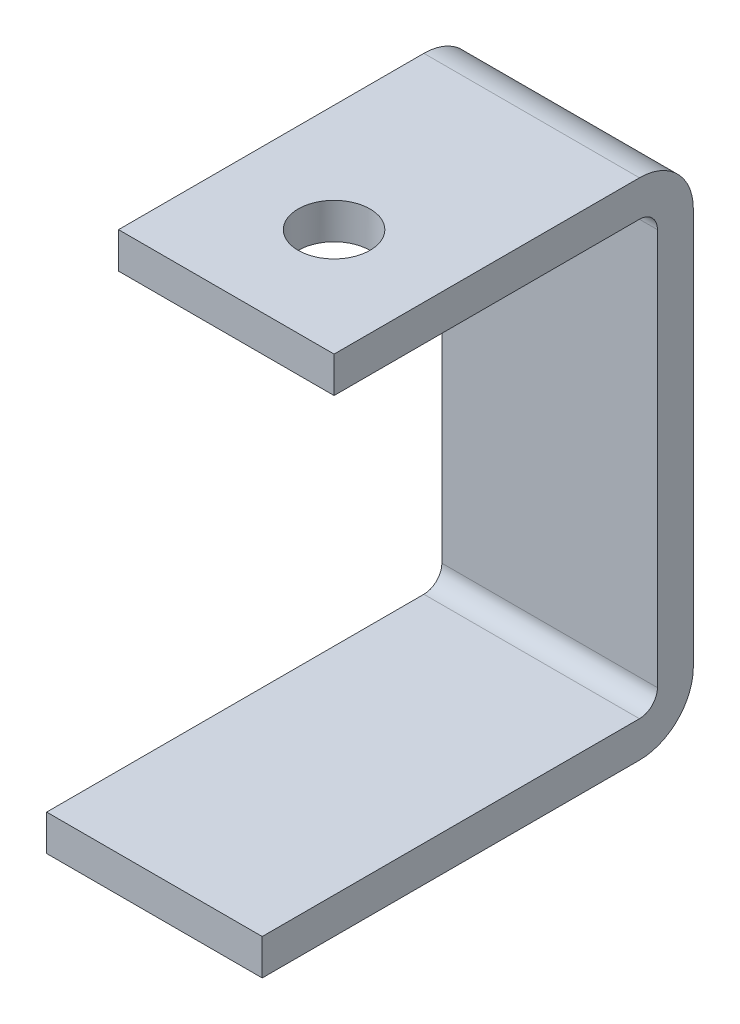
from build123d import *

# Parameters (mm, degrees)
BASE_EXTRUDE_THIN_DEPTH = 19.05
CUT_EXTRUDE1_REACH      = 116.849
SKETCH2_R               = 6.35


with BuildPart() as part:
    # Sketch1 → Base-Extrude-Thin (new, symmetric)
    with BuildSketch(Plane(origin=(0, 0, 0), x_dir=(0, 0, -1), z_dir=(1, 0, 0))):
        with BuildLine():
            Line((-69.85, 0), (-44.45, 0))
            Line((-44.45, 0), (-3.175, 0))
            ThreePointArc((-3.175, 0), (-0.92993597, 0.92993597), (0, 3.175))
            Line((0, 3.175), (0, 73.279))
            ThreePointArc((0, 73.279), (-0.92993597, 75.52406403), (-3.175, 76.454))
            Line((-3.175, 76.454), (-57.15, 76.454))
            Line((-57.15, 76.454), (-57.15, 82.804))
            Line((-57.15, 82.804), (-3.175, 82.804))
            ThreePointArc((-3.175, 82.804), (3.560192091, 80.014192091), (6.35, 73.279))
            Line((6.35, 73.279), (6.35, 3.175))
            ThreePointArc((6.35, 3.175), (3.560192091, -3.560192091), (-3.175, -6.35))
            Line((-3.175, -6.35), (-44.45, -6.35))
            Line((-44.45, -6.35), (-69.85, -6.35))
            Line((-69.85, -6.35), (-69.85, 0))
        make_face()
    extrude(amount=BASE_EXTRUDE_THIN_DEPTH, both=True)

    # Sketch2 → Cut-Extrude1 (cut, up to next)
    with BuildSketch(Plane(origin=(0, 82.804, 0), x_dir=(-1, 0, 0), z_dir=(0, 1, 0)), mode=Mode.PRIVATE) as cut_extrude1_sk1:
        with Locations(Location((0, 38.1, 0), (0, 0, 90))):
            Circle(SKETCH2_R)
    cut_extrude1_tool1 = extrude(cut_extrude1_sk1.sketch, amount=-CUT_EXTRUDE1_REACH, mode=Mode.PRIVATE) & part.part
    add(cut_extrude1_tool1.solids().sort_by_distance((0, 82.804, 38.1))[0], mode=Mode.SUBTRACT)


solid = part.part
